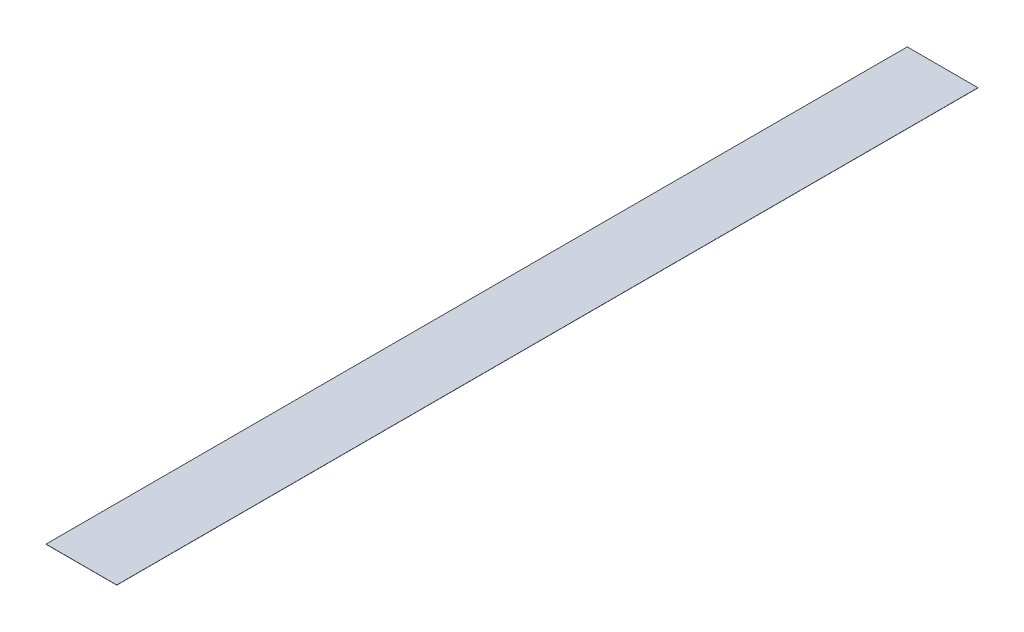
ISO-10303-21;
HEADER;
FILE_DESCRIPTION(('STEP AP214'),'2;1');
FILE_NAME('part.step','',(''),(''),'','','');
FILE_SCHEMA(('AUTOMOTIVE_DESIGN { 1 0 10303 214 1 1 1 1 }'));
ENDSEC;
DATA;
#1=APPLICATION_CONTEXT('core data for automotive mechanical design processes');
#2=APPLICATION_PROTOCOL_DEFINITION('international standard','automotive_design',2000,#1);
#3=PRODUCT_CONTEXT('',#1,'mechanical');
#4=PRODUCT('Part','Part','',(#3));
#5=PRODUCT_RELATED_PRODUCT_CATEGORY('part','',(#4));
#6=PRODUCT_DEFINITION_FORMATION('','',#4);
#7=PRODUCT_DEFINITION_CONTEXT('part definition',#1,'design');
#8=PRODUCT_DEFINITION('design','',#6,#7);
#9=PRODUCT_DEFINITION_SHAPE('','',#8);
#10=(LENGTH_UNIT() NAMED_UNIT(*) SI_UNIT(.MILLI.,.METRE.));
#11=(NAMED_UNIT(*) PLANE_ANGLE_UNIT() SI_UNIT($,.RADIAN.));
#12=(NAMED_UNIT(*) SI_UNIT($,.STERADIAN.) SOLID_ANGLE_UNIT());
#13=UNCERTAINTY_MEASURE_WITH_UNIT(LENGTH_MEASURE(1.E-05),#10,'distance_accuracy_value','');
#14=(GEOMETRIC_REPRESENTATION_CONTEXT(3) GLOBAL_UNCERTAINTY_ASSIGNED_CONTEXT((#13)) GLOBAL_UNIT_ASSIGNED_CONTEXT((#10,
#11,#12)) REPRESENTATION_CONTEXT('',''));
#15=CARTESIAN_POINT('',(0.,0.,0.));
#16=DIRECTION('',(0.,0.,1.));
#17=DIRECTION('',(1.,0.,0.));
#18=AXIS2_PLACEMENT_3D('',#15,#16,#17);
#19=CARTESIAN_POINT('',(-12.3027,0.0508,-149.75));
#20=DIRECTION('',(1.,0.,0.));
#21=DIRECTION('',(0.,0.,-1.));
#22=AXIS2_PLACEMENT_3D('',#19,#20,#21);
#23=PLANE('',#22);
#24=DIRECTION('',(0.,0.,1.));
#25=VECTOR('',#24,1.);
#26=CARTESIAN_POINT('',(-12.3027,0.,-149.75));
#27=LINE('',#26,#25);
#28=CARTESIAN_POINT('',(-12.3027,0.,-149.75));
#29=VERTEX_POINT('',#28);
#30=CARTESIAN_POINT('',(-12.3027,0.,149.75));
#31=VERTEX_POINT('',#30);
#32=EDGE_CURVE('E98',#29,#31,#27,.T.);
#33=ORIENTED_EDGE('',*,*,#32,.T.);
#34=DIRECTION('',(0.,-1.,0.));
#35=VECTOR('',#34,1.);
#36=CARTESIAN_POINT('',(-12.3027,0.0508,149.75));
#37=LINE('',#36,#35);
#38=CARTESIAN_POINT('',(-12.3027,0.0508,149.75));
#39=VERTEX_POINT('',#38);
#40=EDGE_CURVE('E11',#39,#31,#37,.T.);
#41=ORIENTED_EDGE('',*,*,#40,.F.);
#42=DIRECTION('',(0.,0.,1.));
#43=VECTOR('',#42,1.);
#44=CARTESIAN_POINT('',(-12.3027,0.0508,-149.75));
#45=LINE('',#44,#43);
#46=CARTESIAN_POINT('',(-12.3027,0.0508,-149.75));
#47=VERTEX_POINT('',#46);
#48=EDGE_CURVE('E86',#47,#39,#45,.T.);
#49=ORIENTED_EDGE('',*,*,#48,.F.);
#50=DIRECTION('',(0.,-1.,0.));
#51=VECTOR('',#50,1.);
#52=CARTESIAN_POINT('',(-12.3027,0.0508,-149.75));
#53=LINE('',#52,#51);
#54=EDGE_CURVE('E94',#47,#29,#53,.T.);
#55=ORIENTED_EDGE('',*,*,#54,.T.);
#56=EDGE_LOOP('',(#33,#41,#49,#55));
#57=FACE_BOUND('',#56,.T.);
#58=ADVANCED_FACE('F35',(#57),#23,.F.);
#59=CARTESIAN_POINT('',(-12.3027,0.0508,149.75));
#60=DIRECTION('',(0.,0.,-1.));
#61=DIRECTION('',(-1.,0.,0.));
#62=AXIS2_PLACEMENT_3D('',#59,#60,#61);
#63=PLANE('',#62);
#64=DIRECTION('',(1.,0.,0.));
#65=VECTOR('',#64,1.);
#66=CARTESIAN_POINT('',(-12.3027,0.,149.75));
#67=LINE('',#66,#65);
#68=CARTESIAN_POINT('',(12.3027,0.,149.75));
#69=VERTEX_POINT('',#68);
#70=EDGE_CURVE('E90',#31,#69,#67,.T.);
#71=ORIENTED_EDGE('',*,*,#70,.T.);
#72=DIRECTION('',(0.,-1.,0.));
#73=VECTOR('',#72,1.);
#74=CARTESIAN_POINT('',(12.3027,0.0508,149.75));
#75=LINE('',#74,#73);
#76=CARTESIAN_POINT('',(12.3027,0.0508,149.75));
#77=VERTEX_POINT('',#76);
#78=EDGE_CURVE('E43',#77,#69,#75,.T.);
#79=ORIENTED_EDGE('',*,*,#78,.F.);
#80=DIRECTION('',(1.,0.,0.));
#81=VECTOR('',#80,1.);
#82=CARTESIAN_POINT('',(-12.3027,0.0508,149.75));
#83=LINE('',#82,#81);
#84=EDGE_CURVE('E81',#39,#77,#83,.T.);
#85=ORIENTED_EDGE('',*,*,#84,.F.);
#86=ORIENTED_EDGE('',*,*,#40,.T.);
#87=EDGE_LOOP('',(#71,#79,#85,#86));
#88=FACE_BOUND('',#87,.T.);
#89=ADVANCED_FACE('F89',(#88),#63,.F.);
#90=CARTESIAN_POINT('',(12.3027,0.0508,-149.75));
#91=DIRECTION('',(-1.,0.,0.));
#92=DIRECTION('',(0.,0.,1.));
#93=AXIS2_PLACEMENT_3D('',#90,#91,#92);
#94=PLANE('',#93);
#95=DIRECTION('',(0.,0.,-1.));
#96=VECTOR('',#95,1.);
#97=CARTESIAN_POINT('',(12.3027,0.,-149.75));
#98=LINE('',#97,#96);
#99=CARTESIAN_POINT('',(12.3027,0.,-149.75));
#100=VERTEX_POINT('',#99);
#101=EDGE_CURVE('E68',#69,#100,#98,.T.);
#102=ORIENTED_EDGE('',*,*,#101,.T.);
#103=DIRECTION('',(0.,-1.,0.));
#104=VECTOR('',#103,1.);
#105=CARTESIAN_POINT('',(12.3027,0.0508,-149.75));
#106=LINE('',#105,#104);
#107=CARTESIAN_POINT('',(12.3027,0.0508,-149.75));
#108=VERTEX_POINT('',#107);
#109=EDGE_CURVE('E91',#108,#100,#106,.T.);
#110=ORIENTED_EDGE('',*,*,#109,.F.);
#111=DIRECTION('',(0.,0.,-1.));
#112=VECTOR('',#111,1.);
#113=CARTESIAN_POINT('',(12.3027,0.0508,-149.75));
#114=LINE('',#113,#112);
#115=EDGE_CURVE('E84',#77,#108,#114,.T.);
#116=ORIENTED_EDGE('',*,*,#115,.F.);
#117=ORIENTED_EDGE('',*,*,#78,.T.);
#118=EDGE_LOOP('',(#102,#110,#116,#117));
#119=FACE_BOUND('',#118,.T.);
#120=ADVANCED_FACE('F92',(#119),#94,.F.);
#121=CARTESIAN_POINT('',(-12.3027,0.0508,-149.75));
#122=DIRECTION('',(0.,0.,1.));
#123=DIRECTION('',(1.,0.,0.));
#124=AXIS2_PLACEMENT_3D('',#121,#122,#123);
#125=PLANE('',#124);
#126=DIRECTION('',(-1.,0.,0.));
#127=VECTOR('',#126,1.);
#128=CARTESIAN_POINT('',(-12.3027,0.,-149.75));
#129=LINE('',#128,#127);
#130=EDGE_CURVE('E74',#100,#29,#129,.T.);
#131=ORIENTED_EDGE('',*,*,#130,.T.);
#132=ORIENTED_EDGE('',*,*,#54,.F.);
#133=DIRECTION('',(-1.,0.,0.));
#134=VECTOR('',#133,1.);
#135=CARTESIAN_POINT('',(-12.3027,0.0508,-149.75));
#136=LINE('',#135,#134);
#137=EDGE_CURVE('E51',#108,#47,#136,.T.);
#138=ORIENTED_EDGE('',*,*,#137,.F.);
#139=ORIENTED_EDGE('',*,*,#109,.T.);
#140=EDGE_LOOP('',(#131,#132,#138,#139));
#141=FACE_BOUND('',#140,.T.);
#142=ADVANCED_FACE('F105',(#141),#125,.F.);
#143=CARTESIAN_POINT('',(-12.3027,0.0508,149.75));
#144=DIRECTION('',(0.,1.,0.));
#145=DIRECTION('',(0.,0.,1.));
#146=AXIS2_PLACEMENT_3D('',#143,#144,#145);
#147=PLANE('',#146);
#148=ORIENTED_EDGE('',*,*,#48,.T.);
#149=ORIENTED_EDGE('',*,*,#84,.T.);
#150=ORIENTED_EDGE('',*,*,#115,.T.);
#151=ORIENTED_EDGE('',*,*,#137,.T.);
#152=EDGE_LOOP('',(#148,#149,#150,#151));
#153=FACE_BOUND('',#152,.T.);
#154=ADVANCED_FACE('F82',(#153),#147,.T.);
#155=CARTESIAN_POINT('',(-12.3027,0.,149.75));
#156=DIRECTION('',(0.,1.,0.));
#157=DIRECTION('',(0.,0.,1.));
#158=AXIS2_PLACEMENT_3D('',#155,#156,#157);
#159=PLANE('',#158);
#160=ORIENTED_EDGE('',*,*,#32,.F.);
#161=ORIENTED_EDGE('',*,*,#130,.F.);
#162=ORIENTED_EDGE('',*,*,#101,.F.);
#163=ORIENTED_EDGE('',*,*,#70,.F.);
#164=EDGE_LOOP('',(#160,#161,#162,#163));
#165=FACE_BOUND('',#164,.T.);
#166=ADVANCED_FACE('F108',(#165),#159,.F.);
#167=CLOSED_SHELL('',(#58,#89,#120,#142,#154,#166));
#168=MANIFOLD_SOLID_BREP('B2',#167);
#169=ADVANCED_BREP_SHAPE_REPRESENTATION('',(#18,#168),#14);
#170=SHAPE_DEFINITION_REPRESENTATION(#9,#169);
ENDSEC;
END-ISO-10303-21;
